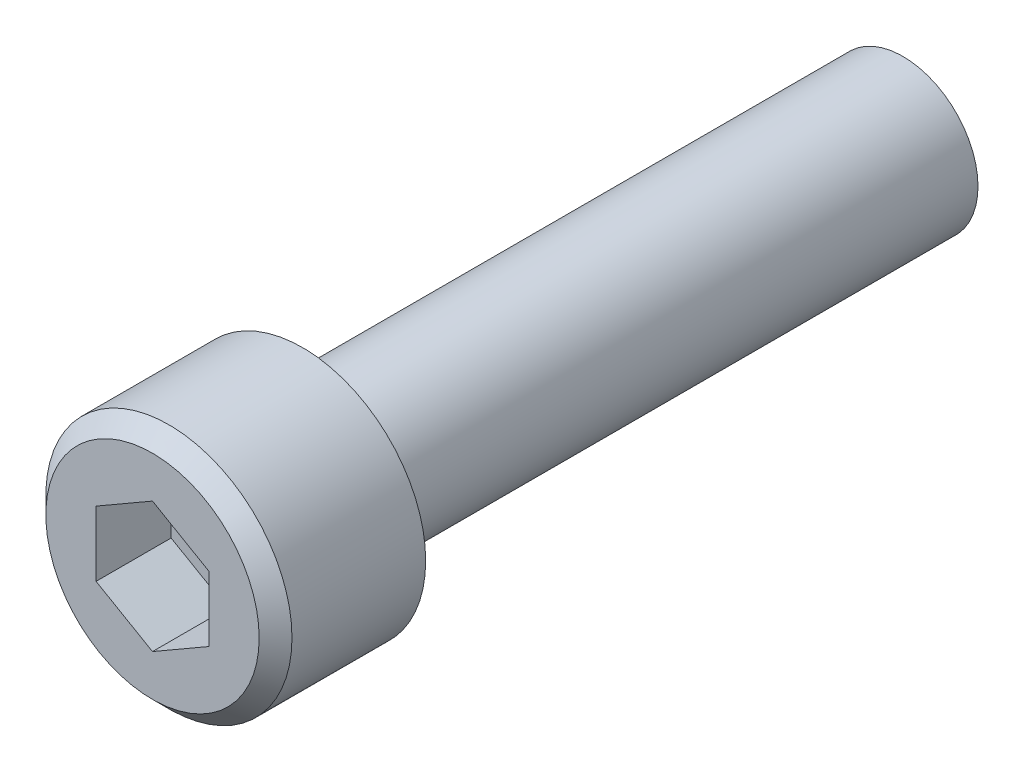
from build123d import *

# Parameters (mm, degrees)
SKETCH1_R     = 1.5875
SHANK_DEPTH   = 12.7
SKETCH2_R     = 2.6035
CAP_DEPTH     = 3.175
FILLET1_R     = 0.254
HEXCUT_DEPTH  = 1.5875
CHAMFER1_SIZE = 0.347133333


with BuildPart() as part:
    # Sketch1 → Shank (new body)
    with BuildSketch(Plane.XY):
        Circle(SKETCH1_R)
    extrude(amount=SHANK_DEPTH)

    # Sketch2 → Cap (add)
    with BuildSketch(Plane.XY.offset(12.7)):
        Circle(SKETCH2_R)
    extrude(amount=CAP_DEPTH)

    # Fillet1
    fillet1_edges = [part.edges().sort_by_distance(p)[0] for p in [
        (-1.5875, 0, 12.7),
    ]]
    fillet(fillet1_edges, radius=FILLET1_R)

    # Sketch3 → HexCut (cut)
    with BuildSketch(Plane(origin=(4.874850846, 0.925692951, 15.875), x_dir=(1, 0, 0), z_dir=(0, 0, 1))):
        Polygon((-4.874850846, 0.452788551), (-3.681050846, -0.2364522), (-3.681050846, -1.614933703), (-4.874850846, -2.304174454), (-6.068650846, -1.614933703), (-6.068650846, -0.2364522), align=None)
    extrude(amount=-HEXCUT_DEPTH, mode=Mode.SUBTRACT)

    # Chamfer1
    chamfer1_edges = [part.edges().sort_by_distance(p)[0] for p in [
        (-2.6035, 0, 15.875),
    ]]
    chamfer(chamfer1_edges, length=CHAMFER1_SIZE)


solid = part.part
